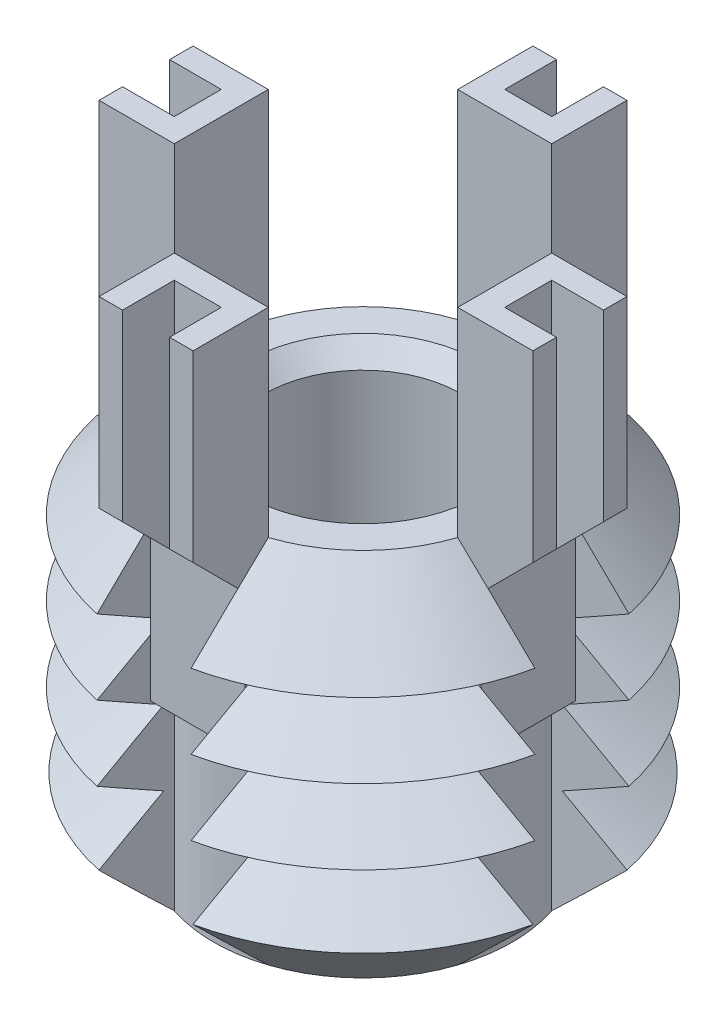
from build123d import *

# Parameters (mm, degrees)
SKETCH1_R               = 4.7625
BOSS_EXTRUDE1_DEPTH     = 7.874
CHAMFER1_SIZE           = 1.587
LPATTERN1_COUNT         = 3
LPATTERN1_PITCH         = 1.587
CUT_EXTRUDE1_REACH      = 12.362
CIRPATTERN1_COUNT       = 4
BOSS_EXTRUDE3_DEPTH     = 1
CIRPATTERN2_COUNT       = 4
CUT_EXTRUDE3_DEPTH      = 14.787225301
CUT_EXTRUDE3_DEPTH_BACK = 14.787225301
SKETCH6_W               = 1.1
SKETCH6_H               = 1
SKETCH6_W_2             = 1
SKETCH6_H_2             = 1.1
SKETCH7_R               = 2.083
CUT_EXTRUDE4_DEPTH      = 7.874
CHAMFER2_SIZE           = 0.397


with BuildPart() as part:
    # Sketch1 → Boss-Extrude1 (new body)
    with BuildSketch(Plane(origin=(0, 0, 0), x_dir=(1, 0, 0), z_dir=(0, 1, 0))):
        with Locations(Location((0, 0, 0), (0, 0, 270))):
            Circle(SKETCH1_R)
    extrude(amount=-BOSS_EXTRUDE1_DEPTH)

    # Chamfer1
    chamfer1_edges = [part.edges().sort_by_distance(p)[0] for p in [
        (0, 0, -4.7625),
        (0, -7.874, -4.7625),
    ]]
    chamfer(chamfer1_edges, length=CHAMFER1_SIZE)

    # Sketch3 → Cut-Revolve1 (revolve, cut)
    with BuildSketch(Plane(origin=(0, 0, 0), x_dir=(0, 0, -1), z_dir=(1, 0, 0))):
        Polygon((-4.7625, -1.587), (-3.388117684, -2.3805), (-4.7625, -3.174), align=None)
    cut_revolve1 = revolve(axis=Axis((0, 0.885892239, 0), (0, -1, 0)), mode=Mode.SUBTRACT)

    # LPattern1: Cut-Revolve1 ×3
    with Locations(*[(0, -i * LPATTERN1_PITCH, 0) for i in range(1, LPATTERN1_COUNT)]):
        add(cut_revolve1, mode=Mode.SUBTRACT)

    # Cut-Extrude1: up to this cone (the profile starts inside it)
    cut_extrude1_end = Plane(origin=(0, 0, 0), z_dir=(0, 1, 0)).offset(-11.049499) * Cone(1e-06, 34.961, 34.960999, align=(Align.CENTER, Align.CENTER, Align.MIN), mode=Mode.PRIVATE)
    # Sketch4 → Cut-Extrude1 (cut, up to the surface)
    with BuildSketch(Plane(origin=(0, 0, 0), x_dir=(1, 0, 0), z_dir=(0, 1, 0)), mode=Mode.PRIVATE) as cut_extrude1_sk1:
        with BuildLine():
            Line((-3.013934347, 1), (-4.656329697, 1))
            ThreePointArc((-4.656329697, 1), (-4.7625, 0), (-4.656329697, -1))
            Line((-4.656329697, -1), (-3.013934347, -1))
            ThreePointArc((-3.013934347, -1), (-3.1755, 0), (-3.013934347, 1))
        make_face()
    cut_extrude1_tool1 = extrude(cut_extrude1_sk1.sketch, amount=-CUT_EXTRUDE1_REACH, mode=Mode.PRIVATE) & cut_extrude1_end
    cut_extrude1 = cut_extrude1_tool1.solids().sort_by_distance((-3.924331, 0, 0))[0]
    add(cut_extrude1, mode=Mode.SUBTRACT)

    # CirPattern1: Cut-Extrude1 ×4 about axis
    cirpattern1_axis = Axis((0, 0, 0), (0, 1, 0))
    for i in range(1, CIRPATTERN1_COUNT):
        add(cut_extrude1.rotate(cirpattern1_axis, i * 360 / CIRPATTERN1_COUNT), mode=Mode.SUBTRACT)

    # Sketch5 → Boss-Extrude3 (add, symmetric)
    with BuildSketch(Plane(origin=(0, 0, 0), x_dir=(0, 0, -1), z_dir=(1, 0, 0))):
        Polygon((-3.013934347, 4.239), (-3.013934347, -3.761), (-3.513934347, -3.761), (-3.513934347, -0.761), (-4.613934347, 0.339), (-4.613934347, 4.239), align=None)
    boss_extrude3 = extrude(amount=BOSS_EXTRUDE3_DEPTH, both=True)

    # CirPattern2: Boss-Extrude3 ×4 about axis
    cirpattern2_axis = Axis((0, 0, 0), (0, 1, 0))
    for i in range(1, CIRPATTERN2_COUNT):
        add(boss_extrude3.rotate(cirpattern2_axis, i * 360 / CIRPATTERN2_COUNT))

    # Sketch6 → Cut-Extrude3 (cut, two sides: drawn at the far end of the back side and taken through both)
    with BuildSketch(Plane(origin=(0, 4.239, 0), x_dir=(1, 0, 0), z_dir=(0, 1, 0)).offset(-CUT_EXTRUDE3_DEPTH_BACK)):
        with Locations((-4.063934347, 0)):
            Rectangle(SKETCH6_W, SKETCH6_H)
        with Locations((0, 4.063934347)):
            Rectangle(SKETCH6_W_2, SKETCH6_H_2)
        with Locations((4.063934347, 0)):
            Rectangle(SKETCH6_W, SKETCH6_H)
        with Locations((0, -4.063934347)):
            Rectangle(SKETCH6_W_2, SKETCH6_H_2)
    extrude(amount=CUT_EXTRUDE3_DEPTH + CUT_EXTRUDE3_DEPTH_BACK, mode=Mode.SUBTRACT)

    # Sketch7 → Cut-Extrude4 (cut)
    with BuildSketch(Plane(origin=(0, 0, 0), x_dir=(1, 0, 0), z_dir=(0, 1, 0))):
        with Locations(Location((0, 0, 0), (0, 0, 270))):
            Circle(SKETCH7_R)
    extrude(amount=-CUT_EXTRUDE4_DEPTH, mode=Mode.SUBTRACT)

    # Chamfer2
    chamfer2_edges = [part.edges().sort_by_distance(p)[0] for p in [
        (0, 0, -2.083),
        (0, -7.874, -2.083),
    ]]
    chamfer(chamfer2_edges, length=CHAMFER2_SIZE)


solid = part.part
